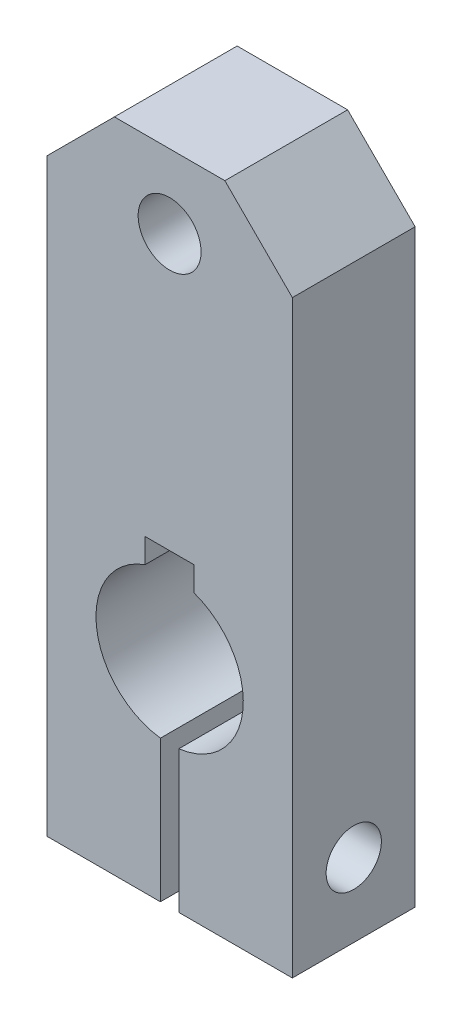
from build123d import *

# Parameters (mm, degrees)
ESQUISSE1_R             = 5.125
BASE_EXTRUSION_DEPTH    = 10
ENL_V_MAT_EXTRU_1_REACH = 116.669
ESQUISSE2_R             = 4.5
ESQUISSE3_R             = 3.375
TROU_TARAUD_DEPTH       = 110.595848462


with BuildPart() as part:
    # Esquisse1 → Base-Extrusion (new, symmetric)
    with BuildSketch(Plane.XY):
        with BuildLine():
            Line((9, 107), (20, 96))
            Line((20, 96), (20, 0))
            Line((20, 0), (1.5, 0))
            Line((1.5, 0), (1.5, 23.0941191))
            ThreePointArc((1.5, 23.0941191), (11.931044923, 33.715411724), (4, 46.313708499))
            Line((4, 46.313708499), (4, 50.3))
            Line((4, 50.3), (-4, 50.3))
            Line((-4, 50.3), (-4, 46.313708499))
            ThreePointArc((-4, 46.313708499), (-11.931044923, 33.715411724), (-1.5, 23.0941191))
            Line((-1.5, 23.0941191), (-1.5, 0))
            Line((-1.5, 0), (-20, 0))
            Line((-20, 0), (-20, 96))
            Line((-20, 96), (-9, 107))
            Line((-9, 107), (9, 107))
        make_face()
        with Locations((0, 95)):
            Circle(ESQUISSE1_R, mode=Mode.SUBTRACT)
    extrude(amount=BASE_EXTRUSION_DEPTH, both=True)

    # Esquisse2 → Enl_v. mat.-Extru.1 (cut, up to next)
    with BuildSketch(Plane(origin=(20, 0, 0), x_dir=(0, 0, -1), z_dir=(1, 0, 0)), mode=Mode.PRIVATE) as enl_v_mat_extru_1_sk1:
        with Locations(Location((0, 12, 0), (0, 0, 90))):
            Circle(ESQUISSE2_R)
    enl_v_mat_extru_1_tool1 = extrude(enl_v_mat_extru_1_sk1.sketch, amount=-ENL_V_MAT_EXTRU_1_REACH, mode=Mode.PRIVATE) & part.part
    add(enl_v_mat_extru_1_tool1.solids().sort_by_distance((20, 12, 0))[0], mode=Mode.SUBTRACT)

    # Esquisse3 → Trou taraud (cut, through all)
    with BuildSketch(Plane(origin=(-1.5, 0, 0), x_dir=(0, 0, -1), z_dir=(1, 0, 0))):
        with Locations(Location((0, 12, 0), (0, 0, 90))):
            Circle(ESQUISSE3_R)
    extrude(amount=-TROU_TARAUD_DEPTH, mode=Mode.SUBTRACT)


solid = part.part
